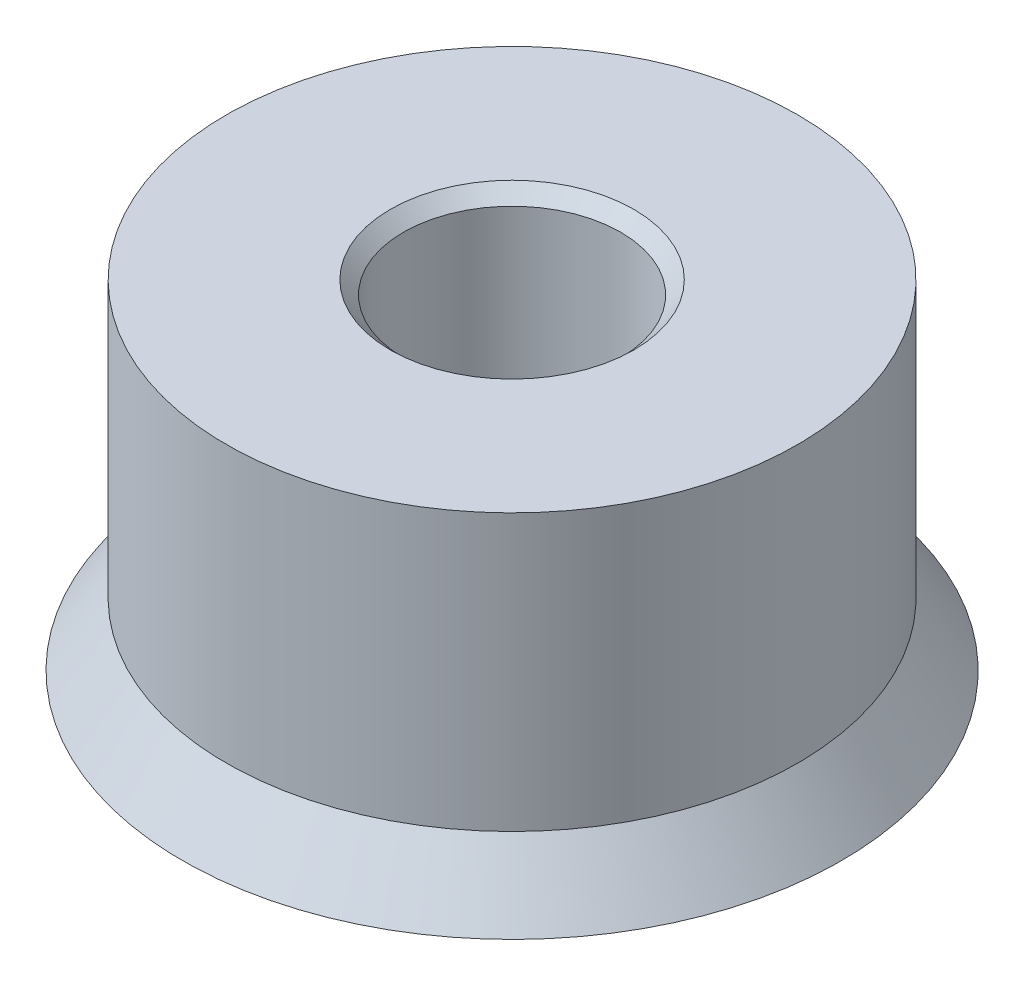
ISO-10303-21;
HEADER;
FILE_DESCRIPTION(('STEP AP214'),'2;1');
FILE_NAME('part.step','',(''),(''),'','','');
FILE_SCHEMA(('AUTOMOTIVE_DESIGN { 1 0 10303 214 1 1 1 1 }'));
ENDSEC;
DATA;
#1=APPLICATION_CONTEXT('core data for automotive mechanical design processes');
#2=APPLICATION_PROTOCOL_DEFINITION('international standard','automotive_design',2000,#1);
#3=PRODUCT_CONTEXT('',#1,'mechanical');
#4=PRODUCT('Part','Part','',(#3));
#5=PRODUCT_RELATED_PRODUCT_CATEGORY('part','',(#4));
#6=PRODUCT_DEFINITION_FORMATION('','',#4);
#7=PRODUCT_DEFINITION_CONTEXT('part definition',#1,'design');
#8=PRODUCT_DEFINITION('design','',#6,#7);
#9=PRODUCT_DEFINITION_SHAPE('','',#8);
#10=(LENGTH_UNIT() NAMED_UNIT(*) SI_UNIT(.MILLI.,.METRE.));
#11=(NAMED_UNIT(*) PLANE_ANGLE_UNIT() SI_UNIT($,.RADIAN.));
#12=(NAMED_UNIT(*) SI_UNIT($,.STERADIAN.) SOLID_ANGLE_UNIT());
#13=UNCERTAINTY_MEASURE_WITH_UNIT(LENGTH_MEASURE(1.E-05),#10,'distance_accuracy_value','');
#14=(GEOMETRIC_REPRESENTATION_CONTEXT(3) GLOBAL_UNCERTAINTY_ASSIGNED_CONTEXT((#13)) GLOBAL_UNIT_ASSIGNED_CONTEXT((#10,
#11,#12)) REPRESENTATION_CONTEXT('',''));
#15=CARTESIAN_POINT('',(0.,0.,0.));
#16=DIRECTION('',(0.,0.,1.));
#17=DIRECTION('',(1.,0.,0.));
#18=AXIS2_PLACEMENT_3D('',#15,#16,#17);
#19=CARTESIAN_POINT('',(0.,-4.88899999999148,0.));
#20=DIRECTION('',(0.,1.,0.));
#21=DIRECTION('',(0.,0.,1.));
#22=AXIS2_PLACEMENT_3D('',#19,#20,#21);
#23=CONICAL_SURFACE('',#22,2.78700000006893,0.977243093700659);
#24=CARTESIAN_POINT('',(0.,-5.42,0.));
#25=DIRECTION('',(0.,-1.,0.));
#26=DIRECTION('',(0.,0.,-1.));
#27=AXIS2_PLACEMENT_3D('',#24,#25,#26);
#28=CIRCLE('',#27,2.);
#29=CARTESIAN_POINT('',(0.,-5.42,-2.));
#30=VERTEX_POINT('',#29);
#31=EDGE_CURVE('E50',#30,#30,#28,.T.);
#32=ORIENTED_EDGE('',*,*,#31,.T.);
#33=EDGE_LOOP('',(#32));
#34=FACE_BOUND('',#33,.T.);
#35=CARTESIAN_POINT('',(0.,-4.889,0.));
#36=DIRECTION('',(0.,-1.,0.));
#37=DIRECTION('',(0.,0.,-1.));
#38=AXIS2_PLACEMENT_3D('',#35,#36,#37);
#39=CIRCLE('',#38,2.787);
#40=CARTESIAN_POINT('',(0.,-4.889,-2.787));
#41=VERTEX_POINT('',#40);
#42=EDGE_CURVE('E59',#41,#41,#39,.F.);
#43=ORIENTED_EDGE('',*,*,#42,.T.);
#44=EDGE_LOOP('',(#43));
#45=FACE_BOUND('',#44,.T.);
#46=ADVANCED_FACE('F14',(#34,#45),#23,.F.);
#47=CARTESIAN_POINT('',(0.,42.3,0.));
#48=DIRECTION('',(0.,-1.,0.));
#49=DIRECTION('',(0.,0.,-1.));
#50=AXIS2_PLACEMENT_3D('',#47,#48,#49);
#51=CYLINDRICAL_SURFACE('',#50,2.787);
#52=ORIENTED_EDGE('',*,*,#42,.F.);
#53=EDGE_LOOP('',(#52));
#54=FACE_BOUND('',#53,.T.);
#55=CARTESIAN_POINT('',(0.,-4.233,0.));
#56=DIRECTION('',(0.,-1.,0.));
#57=DIRECTION('',(0.,0.,-1.));
#58=AXIS2_PLACEMENT_3D('',#55,#56,#57);
#59=CIRCLE('',#58,2.787);
#60=CARTESIAN_POINT('',(0.,-4.233,-2.787));
#61=VERTEX_POINT('',#60);
#62=EDGE_CURVE('E17',#61,#61,#59,.T.);
#63=ORIENTED_EDGE('',*,*,#62,.F.);
#64=EDGE_LOOP('',(#63));
#65=FACE_BOUND('',#64,.T.);
#66=ADVANCED_FACE('F65',(#54,#65),#51,.F.);
#67=CARTESIAN_POINT('',(0.,42.3,0.));
#68=DIRECTION('',(0.,-1.,0.));
#69=DIRECTION('',(0.,0.,-1.));
#70=AXIS2_PLACEMENT_3D('',#67,#68,#69);
#71=CYLINDRICAL_SURFACE('',#70,2.);
#72=CARTESIAN_POINT('',(0.,-5.7199999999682,0.));
#73=DIRECTION('',(0.,-1.,0.));
#74=DIRECTION('',(0.,0.,-1.));
#75=AXIS2_PLACEMENT_3D('',#72,#73,#74);
#76=CIRCLE('',#75,1.9999999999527);
#77=CARTESIAN_POINT('',(0.,-5.7199999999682,-1.99999999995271));
#78=VERTEX_POINT('',#77);
#79=EDGE_CURVE('E42',#78,#78,#76,.T.);
#80=ORIENTED_EDGE('',*,*,#79,.T.);
#81=EDGE_LOOP('',(#80));
#82=FACE_BOUND('',#81,.T.);
#83=ORIENTED_EDGE('',*,*,#31,.F.);
#84=EDGE_LOOP('',(#83));
#85=FACE_BOUND('',#84,.T.);
#86=ADVANCED_FACE('F68',(#82,#85),#71,.F.);
#87=CARTESIAN_POINT('',(0.,-4.233,2.787));
#88=DIRECTION('',(0.,-1.,0.));
#89=DIRECTION('',(0.,0.,-1.));
#90=AXIS2_PLACEMENT_3D('',#87,#88,#89);
#91=PLANE('',#90);
#92=ORIENTED_EDGE('',*,*,#62,.T.);
#93=EDGE_LOOP('',(#92));
#94=FACE_BOUND('',#93,.T.);
#95=CARTESIAN_POINT('',(0.,-4.233,0.));
#96=DIRECTION('',(0.,-1.,0.));
#97=DIRECTION('',(0.,0.,-1.));
#98=AXIS2_PLACEMENT_3D('',#95,#96,#97);
#99=CIRCLE('',#98,2.472);
#100=CARTESIAN_POINT('',(0.,-4.233,-2.472));
#101=VERTEX_POINT('',#100);
#102=EDGE_CURVE('E40',#101,#101,#99,.F.);
#103=ORIENTED_EDGE('',*,*,#102,.T.);
#104=EDGE_LOOP('',(#103));
#105=FACE_BOUND('',#104,.T.);
#106=ADVANCED_FACE('F71',(#94,#105),#91,.T.);
#107=CARTESIAN_POINT('',(0.,-7.69999999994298,0.));
#108=DIRECTION('',(0.,-1.,0.));
#109=DIRECTION('',(0.,0.,-1.));
#110=AXIS2_PLACEMENT_3D('',#107,#108,#109);
#111=CONICAL_SURFACE('',#110,6.49999999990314,1.15628945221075);
#112=CARTESIAN_POINT('',(0.,-7.699999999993,0.));
#113=DIRECTION('',(0.,-1.,0.));
#114=DIRECTION('',(0.,0.,-1.));
#115=AXIS2_PLACEMENT_3D('',#112,#113,#114);
#116=CIRCLE('',#115,6.50000000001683);
#117=CARTESIAN_POINT('',(0.,-7.699999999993,-6.50000000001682));
#118=VERTEX_POINT('',#117);
#119=EDGE_CURVE('E38',#118,#118,#116,.F.);
#120=CARTESIAN_POINT('',(0.,-7.699999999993,-6.50000000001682));
#121=CARTESIAN_POINT('',(0.,-7.67937499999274,-6.45312500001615));
#122=CARTESIAN_POINT('',(0.,-7.65874999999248,-6.40625000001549));
#123=CARTESIAN_POINT('',(0.,-7.61749999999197,-6.31250000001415));
#124=CARTESIAN_POINT('',(0.,-7.59687499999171,-6.26562500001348));
#125=CARTESIAN_POINT('',(0.,-7.55562499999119,-6.17187500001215));
#126=CARTESIAN_POINT('',(0.,-7.53499999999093,-6.12500000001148));
#127=CARTESIAN_POINT('',(0.,-7.49374999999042,-6.03125000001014));
#128=CARTESIAN_POINT('',(0.,-7.47312499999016,-5.98437500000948));
#129=CARTESIAN_POINT('',(0.,-7.43187499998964,-5.89062500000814));
#130=CARTESIAN_POINT('',(0.,-7.41124999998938,-5.84375000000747));
#131=CARTESIAN_POINT('',(0.,-7.36999999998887,-5.75000000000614));
#132=CARTESIAN_POINT('',(0.,-7.34937499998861,-5.70312500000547));
#133=CARTESIAN_POINT('',(0.,-7.30812499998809,-5.60937500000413));
#134=CARTESIAN_POINT('',(0.,-7.28749999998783,-5.56250000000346));
#135=CARTESIAN_POINT('',(0.,-7.24624999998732,-5.46875000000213));
#136=CARTESIAN_POINT('',(0.,-7.22562499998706,-5.42187500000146));
#137=CARTESIAN_POINT('',(0.,-7.18437499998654,-5.32812500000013));
#138=CARTESIAN_POINT('',(0.,-7.16374999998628,-5.28124999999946));
#139=CARTESIAN_POINT('',(0.,-7.12249999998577,-5.18749999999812));
#140=CARTESIAN_POINT('',(0.,-7.10187499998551,-5.14062499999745));
#141=CARTESIAN_POINT('',(0.,-7.06062499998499,-5.04687499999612));
#142=CARTESIAN_POINT('',(0.,-7.03999999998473,-4.99999999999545));
#143=CARTESIAN_POINT('',(0.,-6.99874999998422,-4.90624999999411));
#144=CARTESIAN_POINT('',(0.,-6.97812499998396,-4.85937499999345));
#145=CARTESIAN_POINT('',(0.,-6.93687499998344,-4.76562499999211));
#146=CARTESIAN_POINT('',(0.,-6.91624999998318,-4.71874999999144));
#147=CARTESIAN_POINT('',(0.,-6.87499999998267,-4.62499999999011));
#148=CARTESIAN_POINT('',(0.,-6.85437499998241,-4.57812499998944));
#149=CARTESIAN_POINT('',(0.,-6.81312499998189,-4.4843749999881));
#150=CARTESIAN_POINT('',(0.,-6.79249999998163,-4.43749999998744));
#151=CARTESIAN_POINT('',(0.,-6.75124999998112,-4.3437499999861));
#152=CARTESIAN_POINT('',(0.,-6.73062499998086,-4.29687499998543));
#153=CARTESIAN_POINT('',(0.,-6.68937499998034,-4.2031249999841));
#154=CARTESIAN_POINT('',(0.,-6.66874999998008,-4.15624999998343));
#155=CARTESIAN_POINT('',(0.,-6.62749999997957,-4.06249999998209));
#156=CARTESIAN_POINT('',(0.,-6.60687499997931,-4.01562499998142));
#157=CARTESIAN_POINT('',(0.,-6.56562499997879,-3.92187499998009));
#158=CARTESIAN_POINT('',(0.,-6.54499999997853,-3.87499999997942));
#159=CARTESIAN_POINT('',(0.,-6.50374999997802,-3.78124999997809));
#160=CARTESIAN_POINT('',(0.,-6.48312499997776,-3.73437499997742));
#161=CARTESIAN_POINT('',(0.,-6.44187499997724,-3.64062499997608));
#162=CARTESIAN_POINT('',(0.,-6.42124999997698,-3.59374999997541));
#163=CARTESIAN_POINT('',(0.,-6.37999999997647,-3.49999999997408));
#164=CARTESIAN_POINT('',(0.,-6.35937499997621,-3.45312499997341));
#165=CARTESIAN_POINT('',(0.,-6.31812499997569,-3.35937499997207));
#166=CARTESIAN_POINT('',(0.,-6.29749999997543,-3.31249999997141));
#167=CARTESIAN_POINT('',(0.,-6.25624999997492,-3.21874999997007));
#168=CARTESIAN_POINT('',(0.,-6.23562499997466,-3.1718749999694));
#169=CARTESIAN_POINT('',(0.,-6.19437499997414,-3.07812499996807));
#170=CARTESIAN_POINT('',(0.,-6.17374999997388,-3.0312499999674));
#171=CARTESIAN_POINT('',(0.,-6.13249999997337,-2.93749999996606));
#172=CARTESIAN_POINT('',(0.,-6.11187499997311,-2.8906249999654));
#173=CARTESIAN_POINT('',(0.,-6.07062499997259,-2.79687499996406));
#174=CARTESIAN_POINT('',(0.,-6.04999999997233,-2.74999999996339));
#175=CARTESIAN_POINT('',(0.,-6.00874999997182,-2.65624999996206));
#176=CARTESIAN_POINT('',(0.,-5.98812499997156,-2.60937499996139));
#177=CARTESIAN_POINT('',(0.,-5.94687499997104,-2.51562499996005));
#178=CARTESIAN_POINT('',(0.,-5.92624999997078,-2.46874999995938));
#179=CARTESIAN_POINT('',(0.,-5.88499999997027,-2.37499999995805));
#180=CARTESIAN_POINT('',(0.,-5.86437499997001,-2.32812499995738));
#181=CARTESIAN_POINT('',(0.,-5.82312499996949,-2.23437499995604));
#182=CARTESIAN_POINT('',(0.,-5.80249999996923,-2.18749999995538));
#183=CARTESIAN_POINT('',(0.,-5.76124999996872,-2.09374999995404));
#184=CARTESIAN_POINT('',(0.,-5.74062499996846,-2.04687499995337));
#185=CARTESIAN_POINT('',(0.,-5.7199999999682,-1.99999999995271));
#186=B_SPLINE_CURVE_WITH_KNOTS('',3,(#120,#121,#122,#123,#124,#125,#126,#127,#128,#129,#130,
#131,#132,#133,#134,#135,#136,#137,#138,#139,#140,#141,#142,#143,#144,#145,#146,#147,#148,#149,
#150,#151,#152,#153,#154,#155,#156,#157,#158,#159,#160,#161,#162,#163,#164,#165,#166,#167,#168,
#169,#170,#171,#172,#173,#174,#175,#176,#177,#178,#179,#180,#181,#182,#183,#184,#185),
.UNSPECIFIED.,.F.,.F.,(4,2,2,2,2,2,2,2,2,2,2,2,2,2,2,2,2,2,2,2,2,2,2,2,2,2,2,2,2,2,2,2,4),(0.,
0.153635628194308,0.307271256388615,0.460906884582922,0.61454251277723,0.768178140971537,
0.921813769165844,1.07544939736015,1.22908502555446,1.38272065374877,1.53635628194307,
1.68999191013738,1.84362753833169,1.997263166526,2.1508987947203,2.30453442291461,
2.45817005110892,2.61180567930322,2.76544130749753,2.91907693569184,3.07271256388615,
3.22634819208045,3.37998382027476,3.53361944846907,3.68725507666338,3.84089070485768,
3.99452633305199,4.1481619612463,4.30179758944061,4.45543321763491,4.60906884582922,
4.76270447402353,4.91634010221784),.UNSPECIFIED.);
#187=EDGE_CURVE('BSEAM73',#118,#78,#186,.T.);
#188=ORIENTED_EDGE('',*,*,#119,.F.);
#189=ORIENTED_EDGE('',*,*,#79,.F.);
#190=ORIENTED_EDGE('',*,*,#187,.T.);
#191=ORIENTED_EDGE('',*,*,#187,.F.);
#192=EDGE_LOOP('',(#188,#190,#189,#191));
#193=FACE_BOUND('',#192,.T.);
#194=ADVANCED_FACE('F73',(#193),#111,.F.);
#195=CARTESIAN_POINT('',(0.,42.3,0.));
#196=DIRECTION('',(0.,-1.,0.));
#197=DIRECTION('',(0.,0.,-1.));
#198=AXIS2_PLACEMENT_3D('',#195,#196,#197);
#199=CYLINDRICAL_SURFACE('',#198,2.472);
#200=ORIENTED_EDGE('',*,*,#102,.F.);
#201=EDGE_LOOP('',(#200));
#202=FACE_BOUND('',#201,.T.);
#203=CARTESIAN_POINT('',(0.,-0.30000000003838,0.));
#204=DIRECTION('',(0.,1.,0.));
#205=DIRECTION('',(0.,0.,1.));
#206=AXIS2_PLACEMENT_3D('',#203,#204,#205);
#207=CIRCLE('',#206,2.47199999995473);
#208=CARTESIAN_POINT('',(0.,-0.30000000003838,2.47199999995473));
#209=VERTEX_POINT('',#208);
#210=EDGE_CURVE('E37',#209,#209,#207,.T.);
#211=ORIENTED_EDGE('',*,*,#210,.T.);
#212=EDGE_LOOP('',(#211));
#213=FACE_BOUND('',#212,.T.);
#214=ADVANCED_FACE('F81',(#202,#213),#199,.F.);
#215=CARTESIAN_POINT('',(0.,-7.7,7.5));
#216=DIRECTION('',(0.,-1.,0.));
#217=DIRECTION('',(0.,0.,-1.));
#218=AXIS2_PLACEMENT_3D('',#215,#216,#217);
#219=PLANE('',#218);
#220=CARTESIAN_POINT('',(0.,-7.69999999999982,0.));
#221=DIRECTION('',(0.,-1.,0.));
#222=DIRECTION('',(0.,0.,-1.));
#223=AXIS2_PLACEMENT_3D('',#220,#221,#222);
#224=CIRCLE('',#223,7.49999999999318);
#225=CARTESIAN_POINT('',(0.,-7.69999999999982,-7.49999999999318));
#226=VERTEX_POINT('',#225);
#227=EDGE_CURVE('E34',#226,#226,#224,.F.);
#228=ORIENTED_EDGE('',*,*,#227,.F.);
#229=EDGE_LOOP('',(#228));
#230=FACE_BOUND('',#229,.T.);
#231=ORIENTED_EDGE('',*,*,#119,.T.);
#232=EDGE_LOOP('',(#231));
#233=FACE_BOUND('',#232,.T.);
#234=ADVANCED_FACE('F104',(#230,#233),#219,.T.);
#235=CARTESIAN_POINT('',(0.,1.13686837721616E-10,0.));
#236=DIRECTION('',(0.,1.,0.));
#237=DIRECTION('',(0.,0.,1.));
#238=AXIS2_PLACEMENT_3D('',#235,#236,#237);
#239=CONICAL_SURFACE('',#238,2.77200000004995,0.78539816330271);
#240=ORIENTED_EDGE('',*,*,#210,.F.);
#241=EDGE_LOOP('',(#240));
#242=FACE_BOUND('',#241,.T.);
#243=CARTESIAN_POINT('',(0.,5.6843418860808E-11,0.));
#244=DIRECTION('',(0.,1.,0.));
#245=DIRECTION('',(0.,0.,1.));
#246=AXIS2_PLACEMENT_3D('',#243,#244,#245);
#247=CIRCLE('',#246,2.77199999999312);
#248=CARTESIAN_POINT('',(0.,5.6843418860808E-11,2.77199999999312));
#249=VERTEX_POINT('',#248);
#250=EDGE_CURVE('E26',#249,#249,#247,.F.);
#251=ORIENTED_EDGE('',*,*,#250,.F.);
#252=EDGE_LOOP('',(#251));
#253=FACE_BOUND('',#252,.T.);
#254=ADVANCED_FACE('F100',(#242,#253),#239,.F.);
#255=CARTESIAN_POINT('',(0.,-7.69999999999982,0.));
#256=DIRECTION('',(0.,-1.,0.));
#257=DIRECTION('',(0.,0.,-1.));
#258=AXIS2_PLACEMENT_3D('',#255,#256,#257);
#259=CONICAL_SURFACE('',#258,7.49999999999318,0.613556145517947);
#260=CARTESIAN_POINT('',(0.,-6.28,0.));
#261=DIRECTION('',(0.,-1.,0.));
#262=DIRECTION('',(0.,0.,-1.));
#263=AXIS2_PLACEMENT_3D('',#260,#261,#262);
#264=CIRCLE('',#263,6.5);
#265=CARTESIAN_POINT('',(0.,-6.28,-6.5));
#266=VERTEX_POINT('',#265);
#267=EDGE_CURVE('E21',#266,#266,#264,.F.);
#268=ORIENTED_EDGE('',*,*,#267,.F.);
#269=EDGE_LOOP('',(#268));
#270=FACE_BOUND('',#269,.T.);
#271=ORIENTED_EDGE('',*,*,#227,.T.);
#272=EDGE_LOOP('',(#271));
#273=FACE_BOUND('',#272,.T.);
#274=ADVANCED_FACE('F93',(#270,#273),#259,.T.);
#275=CARTESIAN_POINT('',(0.,0.,2.772));
#276=DIRECTION('',(0.,1.,0.));
#277=DIRECTION('',(0.,0.,1.));
#278=AXIS2_PLACEMENT_3D('',#275,#276,#277);
#279=PLANE('',#278);
#280=ORIENTED_EDGE('',*,*,#250,.T.);
#281=EDGE_LOOP('',(#280));
#282=FACE_BOUND('',#281,.T.);
#283=CARTESIAN_POINT('',(0.,0.,0.));
#284=DIRECTION('',(0.,-1.,0.));
#285=DIRECTION('',(0.,0.,-1.));
#286=AXIS2_PLACEMENT_3D('',#283,#284,#285);
#287=CIRCLE('',#286,6.5);
#288=CARTESIAN_POINT('',(0.,0.,-6.5));
#289=VERTEX_POINT('',#288);
#290=EDGE_CURVE('E10',#289,#289,#287,.T.);
#291=ORIENTED_EDGE('',*,*,#290,.F.);
#292=EDGE_LOOP('',(#291));
#293=FACE_BOUND('',#292,.T.);
#294=ADVANCED_FACE('F87',(#282,#293),#279,.T.);
#295=CARTESIAN_POINT('',(0.,42.3,0.));
#296=DIRECTION('',(0.,-1.,0.));
#297=DIRECTION('',(0.,0.,-1.));
#298=AXIS2_PLACEMENT_3D('',#295,#296,#297);
#299=CYLINDRICAL_SURFACE('',#298,6.5);
#300=ORIENTED_EDGE('',*,*,#290,.T.);
#301=EDGE_LOOP('',(#300));
#302=FACE_BOUND('',#301,.T.);
#303=ORIENTED_EDGE('',*,*,#267,.T.);
#304=EDGE_LOOP('',(#303));
#305=FACE_BOUND('',#304,.T.);
#306=ADVANCED_FACE('F85',(#302,#305),#299,.T.);
#307=CLOSED_SHELL('',(#46,#66,#86,#106,#194,#214,#234,#254,#274,#294,#306));
#308=MANIFOLD_SOLID_BREP('B1',#307);
#309=ADVANCED_BREP_SHAPE_REPRESENTATION('',(#18,#308),#14);
#310=SHAPE_DEFINITION_REPRESENTATION(#9,#309);
ENDSEC;
END-ISO-10303-21;
